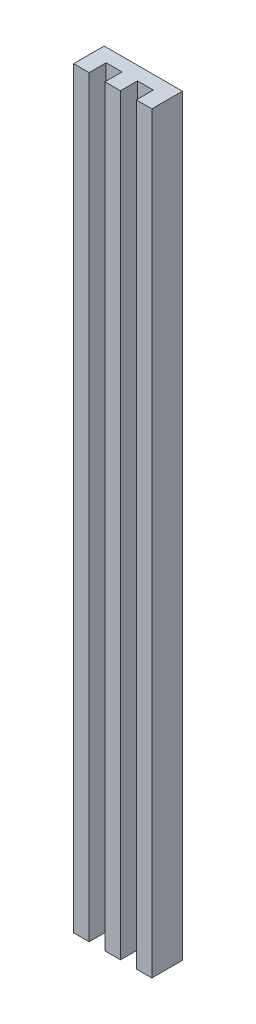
ISO-10303-21;
HEADER;
FILE_DESCRIPTION(('STEP AP214'),'2;1');
FILE_NAME('part.step','',(''),(''),'','','');
FILE_SCHEMA(('AUTOMOTIVE_DESIGN { 1 0 10303 214 1 1 1 1 }'));
ENDSEC;
DATA;
#1=APPLICATION_CONTEXT('core data for automotive mechanical design processes');
#2=APPLICATION_PROTOCOL_DEFINITION('international standard','automotive_design',2000,#1);
#3=PRODUCT_CONTEXT('',#1,'mechanical');
#4=PRODUCT('Part','Part','',(#3));
#5=PRODUCT_RELATED_PRODUCT_CATEGORY('part','',(#4));
#6=PRODUCT_DEFINITION_FORMATION('','',#4);
#7=PRODUCT_DEFINITION_CONTEXT('part definition',#1,'design');
#8=PRODUCT_DEFINITION('design','',#6,#7);
#9=PRODUCT_DEFINITION_SHAPE('','',#8);
#10=(LENGTH_UNIT() NAMED_UNIT(*) SI_UNIT(.MILLI.,.METRE.));
#11=(NAMED_UNIT(*) PLANE_ANGLE_UNIT() SI_UNIT($,.RADIAN.));
#12=(NAMED_UNIT(*) SI_UNIT($,.STERADIAN.) SOLID_ANGLE_UNIT());
#13=UNCERTAINTY_MEASURE_WITH_UNIT(LENGTH_MEASURE(1.E-05),#10,'distance_accuracy_value','');
#14=(GEOMETRIC_REPRESENTATION_CONTEXT(3) GLOBAL_UNCERTAINTY_ASSIGNED_CONTEXT((#13)) GLOBAL_UNIT_ASSIGNED_CONTEXT((#10,
#11,#12)) REPRESENTATION_CONTEXT('',''));
#15=CARTESIAN_POINT('',(0.,0.,0.));
#16=DIRECTION('',(0.,0.,1.));
#17=DIRECTION('',(1.,0.,0.));
#18=AXIS2_PLACEMENT_3D('',#15,#16,#17);
#19=CARTESIAN_POINT('',(3.1,75.,0.));
#20=DIRECTION('',(0.,0.,-1.));
#21=DIRECTION('',(-1.,0.,0.));
#22=AXIS2_PLACEMENT_3D('',#19,#20,#21);
#23=PLANE('',#22);
#24=DIRECTION('',(1.,0.,0.));
#25=VECTOR('',#24,1.);
#26=CARTESIAN_POINT('',(3.1,-75.,0.));
#27=LINE('',#26,#25);
#28=CARTESIAN_POINT('',(0.,-75.,0.));
#29=VERTEX_POINT('',#28);
#30=CARTESIAN_POINT('',(3.1,-75.,0.));
#31=VERTEX_POINT('',#30);
#32=EDGE_CURVE('E153',#29,#31,#27,.T.);
#33=ORIENTED_EDGE('',*,*,#32,.T.);
#34=DIRECTION('',(0.,-1.,0.));
#35=VECTOR('',#34,1.);
#36=CARTESIAN_POINT('',(3.1,75.,0.));
#37=LINE('',#36,#35);
#38=CARTESIAN_POINT('',(3.1,75.,0.));
#39=VERTEX_POINT('',#38);
#40=EDGE_CURVE('E11',#39,#31,#37,.T.);
#41=ORIENTED_EDGE('',*,*,#40,.F.);
#42=DIRECTION('',(1.,0.,0.));
#43=VECTOR('',#42,1.);
#44=CARTESIAN_POINT('',(3.1,75.,0.));
#45=LINE('',#44,#43);
#46=CARTESIAN_POINT('',(0.,75.,0.));
#47=VERTEX_POINT('',#46);
#48=EDGE_CURVE('E175',#47,#39,#45,.T.);
#49=ORIENTED_EDGE('',*,*,#48,.F.);
#50=DIRECTION('',(0.,-1.,0.));
#51=VECTOR('',#50,1.);
#52=CARTESIAN_POINT('',(0.,75.,0.));
#53=LINE('',#52,#51);
#54=EDGE_CURVE('E149',#47,#29,#53,.T.);
#55=ORIENTED_EDGE('',*,*,#54,.T.);
#56=EDGE_LOOP('',(#33,#41,#49,#55));
#57=FACE_BOUND('',#56,.T.);
#58=ADVANCED_FACE('F33',(#57),#23,.F.);
#59=CARTESIAN_POINT('',(3.1,75.,-3.4));
#60=DIRECTION('',(-1.,0.,0.));
#61=DIRECTION('',(0.,0.,1.));
#62=AXIS2_PLACEMENT_3D('',#59,#60,#61);
#63=PLANE('',#62);
#64=DIRECTION('',(0.,0.,-1.));
#65=VECTOR('',#64,1.);
#66=CARTESIAN_POINT('',(3.1,-75.,-3.4));
#67=LINE('',#66,#65);
#68=CARTESIAN_POINT('',(3.1,-75.,-3.4));
#69=VERTEX_POINT('',#68);
#70=EDGE_CURVE('E156',#31,#69,#67,.T.);
#71=ORIENTED_EDGE('',*,*,#70,.T.);
#72=DIRECTION('',(0.,-1.,0.));
#73=VECTOR('',#72,1.);
#74=CARTESIAN_POINT('',(3.1,75.,-3.4));
#75=LINE('',#74,#73);
#76=CARTESIAN_POINT('',(3.1,75.,-3.4));
#77=VERTEX_POINT('',#76);
#78=EDGE_CURVE('E41',#77,#69,#75,.T.);
#79=ORIENTED_EDGE('',*,*,#78,.F.);
#80=DIRECTION('',(0.,0.,-1.));
#81=VECTOR('',#80,1.);
#82=CARTESIAN_POINT('',(3.1,75.,-3.4));
#83=LINE('',#82,#81);
#84=EDGE_CURVE('E104',#39,#77,#83,.T.);
#85=ORIENTED_EDGE('',*,*,#84,.F.);
#86=ORIENTED_EDGE('',*,*,#40,.T.);
#87=EDGE_LOOP('',(#71,#79,#85,#86));
#88=FACE_BOUND('',#87,.T.);
#89=ADVANCED_FACE('F253',(#88),#63,.F.);
#90=CARTESIAN_POINT('',(6.25,75.,-3.4));
#91=DIRECTION('',(0.,0.,-1.));
#92=DIRECTION('',(-1.,0.,0.));
#93=AXIS2_PLACEMENT_3D('',#90,#91,#92);
#94=PLANE('',#93);
#95=DIRECTION('',(1.,0.,0.));
#96=VECTOR('',#95,1.);
#97=CARTESIAN_POINT('',(6.25,-75.,-3.4));
#98=LINE('',#97,#96);
#99=CARTESIAN_POINT('',(6.25,-75.,-3.4));
#100=VERTEX_POINT('',#99);
#101=EDGE_CURVE('E158',#69,#100,#98,.T.);
#102=ORIENTED_EDGE('',*,*,#101,.T.);
#103=DIRECTION('',(0.,-1.,0.));
#104=VECTOR('',#103,1.);
#105=CARTESIAN_POINT('',(6.25,75.,-3.4));
#106=LINE('',#105,#104);
#107=CARTESIAN_POINT('',(6.25,75.,-3.4));
#108=VERTEX_POINT('',#107);
#109=EDGE_CURVE('E194',#108,#100,#106,.T.);
#110=ORIENTED_EDGE('',*,*,#109,.F.);
#111=DIRECTION('',(1.,0.,0.));
#112=VECTOR('',#111,1.);
#113=CARTESIAN_POINT('',(6.25,75.,-3.4));
#114=LINE('',#113,#112);
#115=EDGE_CURVE('E202',#77,#108,#114,.T.);
#116=ORIENTED_EDGE('',*,*,#115,.F.);
#117=ORIENTED_EDGE('',*,*,#78,.T.);
#118=EDGE_LOOP('',(#102,#110,#116,#117));
#119=FACE_BOUND('',#118,.T.);
#120=ADVANCED_FACE('F200',(#119),#94,.F.);
#121=CARTESIAN_POINT('',(6.25,75.,0.));
#122=DIRECTION('',(1.,0.,0.));
#123=DIRECTION('',(0.,0.,-1.));
#124=AXIS2_PLACEMENT_3D('',#121,#122,#123);
#125=PLANE('',#124);
#126=DIRECTION('',(0.,0.,1.));
#127=VECTOR('',#126,1.);
#128=CARTESIAN_POINT('',(6.25,-75.,0.));
#129=LINE('',#128,#127);
#130=CARTESIAN_POINT('',(6.25,-75.,0.));
#131=VERTEX_POINT('',#130);
#132=EDGE_CURVE('E160',#100,#131,#129,.T.);
#133=ORIENTED_EDGE('',*,*,#132,.T.);
#134=DIRECTION('',(0.,-1.,0.));
#135=VECTOR('',#134,1.);
#136=CARTESIAN_POINT('',(6.25,75.,0.));
#137=LINE('',#136,#135);
#138=CARTESIAN_POINT('',(6.25,75.,0.));
#139=VERTEX_POINT('',#138);
#140=EDGE_CURVE('E191',#139,#131,#137,.T.);
#141=ORIENTED_EDGE('',*,*,#140,.F.);
#142=DIRECTION('',(0.,0.,1.));
#143=VECTOR('',#142,1.);
#144=CARTESIAN_POINT('',(6.25,75.,0.));
#145=LINE('',#144,#143);
#146=EDGE_CURVE('E220',#108,#139,#145,.T.);
#147=ORIENTED_EDGE('',*,*,#146,.F.);
#148=ORIENTED_EDGE('',*,*,#109,.T.);
#149=EDGE_LOOP('',(#133,#141,#147,#148));
#150=FACE_BOUND('',#149,.T.);
#151=ADVANCED_FACE('F211',(#150),#125,.F.);
#152=CARTESIAN_POINT('',(9.35,75.,0.));
#153=DIRECTION('',(0.,0.,-1.));
#154=DIRECTION('',(-1.,0.,0.));
#155=AXIS2_PLACEMENT_3D('',#152,#153,#154);
#156=PLANE('',#155);
#157=DIRECTION('',(1.,0.,0.));
#158=VECTOR('',#157,1.);
#159=CARTESIAN_POINT('',(9.35,-75.,0.));
#160=LINE('',#159,#158);
#161=CARTESIAN_POINT('',(9.35,-75.,0.));
#162=VERTEX_POINT('',#161);
#163=EDGE_CURVE('E162',#131,#162,#160,.T.);
#164=ORIENTED_EDGE('',*,*,#163,.T.);
#165=DIRECTION('',(0.,-1.,0.));
#166=VECTOR('',#165,1.);
#167=CARTESIAN_POINT('',(9.35,75.,0.));
#168=LINE('',#167,#166);
#169=CARTESIAN_POINT('',(9.35,75.,0.));
#170=VERTEX_POINT('',#169);
#171=EDGE_CURVE('E188',#170,#162,#168,.T.);
#172=ORIENTED_EDGE('',*,*,#171,.F.);
#173=DIRECTION('',(1.,0.,0.));
#174=VECTOR('',#173,1.);
#175=CARTESIAN_POINT('',(9.35,75.,0.));
#176=LINE('',#175,#174);
#177=EDGE_CURVE('E217',#139,#170,#176,.T.);
#178=ORIENTED_EDGE('',*,*,#177,.F.);
#179=ORIENTED_EDGE('',*,*,#140,.T.);
#180=EDGE_LOOP('',(#164,#172,#178,#179));
#181=FACE_BOUND('',#180,.T.);
#182=ADVANCED_FACE('F215',(#181),#156,.F.);
#183=CARTESIAN_POINT('',(9.35,75.,-3.4));
#184=DIRECTION('',(-1.,0.,0.));
#185=DIRECTION('',(0.,0.,1.));
#186=AXIS2_PLACEMENT_3D('',#183,#184,#185);
#187=PLANE('',#186);
#188=DIRECTION('',(0.,0.,-1.));
#189=VECTOR('',#188,1.);
#190=CARTESIAN_POINT('',(9.35,-75.,-3.4));
#191=LINE('',#190,#189);
#192=CARTESIAN_POINT('',(9.35,-75.,-3.4));
#193=VERTEX_POINT('',#192);
#194=EDGE_CURVE('E164',#162,#193,#191,.T.);
#195=ORIENTED_EDGE('',*,*,#194,.T.);
#196=DIRECTION('',(0.,-1.,0.));
#197=VECTOR('',#196,1.);
#198=CARTESIAN_POINT('',(9.35,75.,-3.4));
#199=LINE('',#198,#197);
#200=CARTESIAN_POINT('',(9.35,75.,-3.4));
#201=VERTEX_POINT('',#200);
#202=EDGE_CURVE('E185',#201,#193,#199,.T.);
#203=ORIENTED_EDGE('',*,*,#202,.F.);
#204=DIRECTION('',(0.,0.,-1.));
#205=VECTOR('',#204,1.);
#206=CARTESIAN_POINT('',(9.35,75.,-3.4));
#207=LINE('',#206,#205);
#208=EDGE_CURVE('E219',#170,#201,#207,.T.);
#209=ORIENTED_EDGE('',*,*,#208,.F.);
#210=ORIENTED_EDGE('',*,*,#171,.T.);
#211=EDGE_LOOP('',(#195,#203,#209,#210));
#212=FACE_BOUND('',#211,.T.);
#213=ADVANCED_FACE('F266',(#212),#187,.F.);
#214=CARTESIAN_POINT('',(12.5,75.,-3.4));
#215=DIRECTION('',(0.,0.,-1.));
#216=DIRECTION('',(-1.,0.,0.));
#217=AXIS2_PLACEMENT_3D('',#214,#215,#216);
#218=PLANE('',#217);
#219=DIRECTION('',(1.,0.,0.));
#220=VECTOR('',#219,1.);
#221=CARTESIAN_POINT('',(12.5,-75.,-3.4));
#222=LINE('',#221,#220);
#223=CARTESIAN_POINT('',(12.5,-75.,-3.4));
#224=VERTEX_POINT('',#223);
#225=EDGE_CURVE('E166',#193,#224,#222,.T.);
#226=ORIENTED_EDGE('',*,*,#225,.T.);
#227=DIRECTION('',(0.,-1.,0.));
#228=VECTOR('',#227,1.);
#229=CARTESIAN_POINT('',(12.5,75.,-3.4));
#230=LINE('',#229,#228);
#231=CARTESIAN_POINT('',(12.5,75.,-3.4));
#232=VERTEX_POINT('',#231);
#233=EDGE_CURVE('E182',#232,#224,#230,.T.);
#234=ORIENTED_EDGE('',*,*,#233,.F.);
#235=DIRECTION('',(1.,0.,0.));
#236=VECTOR('',#235,1.);
#237=CARTESIAN_POINT('',(12.5,75.,-3.4));
#238=LINE('',#237,#236);
#239=EDGE_CURVE('E222',#201,#232,#238,.T.);
#240=ORIENTED_EDGE('',*,*,#239,.F.);
#241=ORIENTED_EDGE('',*,*,#202,.T.);
#242=EDGE_LOOP('',(#226,#234,#240,#241));
#243=FACE_BOUND('',#242,.T.);
#244=ADVANCED_FACE('F269',(#243),#218,.F.);
#245=CARTESIAN_POINT('',(12.5,75.,0.));
#246=DIRECTION('',(1.,0.,0.));
#247=DIRECTION('',(0.,0.,-1.));
#248=AXIS2_PLACEMENT_3D('',#245,#246,#247);
#249=PLANE('',#248);
#250=DIRECTION('',(0.,0.,1.));
#251=VECTOR('',#250,1.);
#252=CARTESIAN_POINT('',(12.5,-75.,0.));
#253=LINE('',#252,#251);
#254=CARTESIAN_POINT('',(12.5,-75.,0.));
#255=VERTEX_POINT('',#254);
#256=EDGE_CURVE('E168',#224,#255,#253,.T.);
#257=ORIENTED_EDGE('',*,*,#256,.T.);
#258=DIRECTION('',(0.,-1.,0.));
#259=VECTOR('',#258,1.);
#260=CARTESIAN_POINT('',(12.5,75.,0.));
#261=LINE('',#260,#259);
#262=CARTESIAN_POINT('',(12.5,75.,0.));
#263=VERTEX_POINT('',#262);
#264=EDGE_CURVE('E179',#263,#255,#261,.T.);
#265=ORIENTED_EDGE('',*,*,#264,.F.);
#266=DIRECTION('',(0.,0.,1.));
#267=VECTOR('',#266,1.);
#268=CARTESIAN_POINT('',(12.5,75.,0.));
#269=LINE('',#268,#267);
#270=EDGE_CURVE('E228',#232,#263,#269,.T.);
#271=ORIENTED_EDGE('',*,*,#270,.F.);
#272=ORIENTED_EDGE('',*,*,#233,.T.);
#273=EDGE_LOOP('',(#257,#265,#271,#272));
#274=FACE_BOUND('',#273,.T.);
#275=ADVANCED_FACE('F234',(#274),#249,.F.);
#276=CARTESIAN_POINT('',(15.6,75.,0.));
#277=DIRECTION('',(0.,0.,-1.));
#278=DIRECTION('',(-1.,0.,0.));
#279=AXIS2_PLACEMENT_3D('',#276,#277,#278);
#280=PLANE('',#279);
#281=DIRECTION('',(1.,0.,0.));
#282=VECTOR('',#281,1.);
#283=CARTESIAN_POINT('',(15.6,-75.,0.));
#284=LINE('',#283,#282);
#285=CARTESIAN_POINT('',(15.6,-75.,0.));
#286=VERTEX_POINT('',#285);
#287=EDGE_CURVE('E170',#255,#286,#284,.T.);
#288=ORIENTED_EDGE('',*,*,#287,.T.);
#289=DIRECTION('',(0.,-1.,0.));
#290=VECTOR('',#289,1.);
#291=CARTESIAN_POINT('',(15.6,75.,0.));
#292=LINE('',#291,#290);
#293=CARTESIAN_POINT('',(15.6,75.,0.));
#294=VERTEX_POINT('',#293);
#295=EDGE_CURVE('E144',#294,#286,#292,.T.);
#296=ORIENTED_EDGE('',*,*,#295,.F.);
#297=DIRECTION('',(1.,0.,0.));
#298=VECTOR('',#297,1.);
#299=CARTESIAN_POINT('',(15.6,75.,0.));
#300=LINE('',#299,#298);
#301=EDGE_CURVE('E135',#263,#294,#300,.T.);
#302=ORIENTED_EDGE('',*,*,#301,.F.);
#303=ORIENTED_EDGE('',*,*,#264,.T.);
#304=EDGE_LOOP('',(#288,#296,#302,#303));
#305=FACE_BOUND('',#304,.T.);
#306=ADVANCED_FACE('F238',(#305),#280,.F.);
#307=CARTESIAN_POINT('',(15.6,75.,-6.1));
#308=DIRECTION('',(-1.,0.,0.));
#309=DIRECTION('',(0.,0.,1.));
#310=AXIS2_PLACEMENT_3D('',#307,#308,#309);
#311=PLANE('',#310);
#312=DIRECTION('',(0.,0.,-1.));
#313=VECTOR('',#312,1.);
#314=CARTESIAN_POINT('',(15.6,-75.,-6.1));
#315=LINE('',#314,#313);
#316=CARTESIAN_POINT('',(15.6,-75.,-6.1));
#317=VERTEX_POINT('',#316);
#318=EDGE_CURVE('E143',#286,#317,#315,.T.);
#319=ORIENTED_EDGE('',*,*,#318,.T.);
#320=DIRECTION('',(0.,-1.,0.));
#321=VECTOR('',#320,1.);
#322=CARTESIAN_POINT('',(15.6,75.,-6.1));
#323=LINE('',#322,#321);
#324=CARTESIAN_POINT('',(15.6,75.,-6.1));
#325=VERTEX_POINT('',#324);
#326=EDGE_CURVE('E140',#325,#317,#323,.T.);
#327=ORIENTED_EDGE('',*,*,#326,.F.);
#328=DIRECTION('',(0.,0.,-1.));
#329=VECTOR('',#328,1.);
#330=CARTESIAN_POINT('',(15.6,75.,-6.1));
#331=LINE('',#330,#329);
#332=EDGE_CURVE('E129',#294,#325,#331,.T.);
#333=ORIENTED_EDGE('',*,*,#332,.F.);
#334=ORIENTED_EDGE('',*,*,#295,.T.);
#335=EDGE_LOOP('',(#319,#327,#333,#334));
#336=FACE_BOUND('',#335,.T.);
#337=ADVANCED_FACE('F141',(#336),#311,.F.);
#338=CARTESIAN_POINT('',(0.,75.,-6.1));
#339=DIRECTION('',(0.,0.,1.));
#340=DIRECTION('',(1.,0.,0.));
#341=AXIS2_PLACEMENT_3D('',#338,#339,#340);
#342=PLANE('',#341);
#343=DIRECTION('',(-1.,0.,0.));
#344=VECTOR('',#343,1.);
#345=CARTESIAN_POINT('',(0.,-75.,-6.1));
#346=LINE('',#345,#344);
#347=CARTESIAN_POINT('',(0.,-75.,-6.1));
#348=VERTEX_POINT('',#347);
#349=EDGE_CURVE('E90',#317,#348,#346,.T.);
#350=ORIENTED_EDGE('',*,*,#349,.T.);
#351=DIRECTION('',(0.,-1.,0.));
#352=VECTOR('',#351,1.);
#353=CARTESIAN_POINT('',(0.,75.,-6.1));
#354=LINE('',#353,#352);
#355=CARTESIAN_POINT('',(0.,75.,-6.1));
#356=VERTEX_POINT('',#355);
#357=EDGE_CURVE('E145',#356,#348,#354,.T.);
#358=ORIENTED_EDGE('',*,*,#357,.F.);
#359=DIRECTION('',(-1.,0.,0.));
#360=VECTOR('',#359,1.);
#361=CARTESIAN_POINT('',(0.,75.,-6.1));
#362=LINE('',#361,#360);
#363=EDGE_CURVE('E133',#325,#356,#362,.T.);
#364=ORIENTED_EDGE('',*,*,#363,.F.);
#365=ORIENTED_EDGE('',*,*,#326,.T.);
#366=EDGE_LOOP('',(#350,#358,#364,#365));
#367=FACE_BOUND('',#366,.T.);
#368=ADVANCED_FACE('F147',(#367),#342,.F.);
#369=CARTESIAN_POINT('',(0.,75.,0.));
#370=DIRECTION('',(1.,0.,0.));
#371=DIRECTION('',(0.,0.,-1.));
#372=AXIS2_PLACEMENT_3D('',#369,#370,#371);
#373=PLANE('',#372);
#374=DIRECTION('',(0.,0.,1.));
#375=VECTOR('',#374,1.);
#376=CARTESIAN_POINT('',(0.,-75.,0.));
#377=LINE('',#376,#375);
#378=EDGE_CURVE('E96',#348,#29,#377,.T.);
#379=ORIENTED_EDGE('',*,*,#378,.T.);
#380=ORIENTED_EDGE('',*,*,#54,.F.);
#381=DIRECTION('',(0.,0.,1.));
#382=VECTOR('',#381,1.);
#383=CARTESIAN_POINT('',(0.,75.,0.));
#384=LINE('',#383,#382);
#385=EDGE_CURVE('E49',#356,#47,#384,.T.);
#386=ORIENTED_EDGE('',*,*,#385,.F.);
#387=ORIENTED_EDGE('',*,*,#357,.T.);
#388=EDGE_LOOP('',(#379,#380,#386,#387));
#389=FACE_BOUND('',#388,.T.);
#390=ADVANCED_FACE('F242',(#389),#373,.F.);
#391=CARTESIAN_POINT('',(0.,75.,0.));
#392=DIRECTION('',(0.,-1.,0.));
#393=DIRECTION('',(0.,0.,-1.));
#394=AXIS2_PLACEMENT_3D('',#391,#392,#393);
#395=PLANE('',#394);
#396=ORIENTED_EDGE('',*,*,#48,.T.);
#397=ORIENTED_EDGE('',*,*,#84,.T.);
#398=ORIENTED_EDGE('',*,*,#115,.T.);
#399=ORIENTED_EDGE('',*,*,#146,.T.);
#400=ORIENTED_EDGE('',*,*,#177,.T.);
#401=ORIENTED_EDGE('',*,*,#208,.T.);
#402=ORIENTED_EDGE('',*,*,#239,.T.);
#403=ORIENTED_EDGE('',*,*,#270,.T.);
#404=ORIENTED_EDGE('',*,*,#301,.T.);
#405=ORIENTED_EDGE('',*,*,#332,.T.);
#406=ORIENTED_EDGE('',*,*,#363,.T.);
#407=ORIENTED_EDGE('',*,*,#385,.T.);
#408=EDGE_LOOP('',(#396,#397,#398,#399,#400,#401,#402,#403,#404,#405,#406,#407));
#409=FACE_BOUND('',#408,.T.);
#410=ADVANCED_FACE('F131',(#409),#395,.F.);
#411=CARTESIAN_POINT('',(0.,-75.,0.));
#412=DIRECTION('',(0.,-1.,0.));
#413=DIRECTION('',(0.,0.,-1.));
#414=AXIS2_PLACEMENT_3D('',#411,#412,#413);
#415=PLANE('',#414);
#416=ORIENTED_EDGE('',*,*,#32,.F.);
#417=ORIENTED_EDGE('',*,*,#378,.F.);
#418=ORIENTED_EDGE('',*,*,#349,.F.);
#419=ORIENTED_EDGE('',*,*,#318,.F.);
#420=ORIENTED_EDGE('',*,*,#287,.F.);
#421=ORIENTED_EDGE('',*,*,#256,.F.);
#422=ORIENTED_EDGE('',*,*,#225,.F.);
#423=ORIENTED_EDGE('',*,*,#194,.F.);
#424=ORIENTED_EDGE('',*,*,#163,.F.);
#425=ORIENTED_EDGE('',*,*,#132,.F.);
#426=ORIENTED_EDGE('',*,*,#101,.F.);
#427=ORIENTED_EDGE('',*,*,#70,.F.);
#428=EDGE_LOOP('',(#416,#417,#418,#419,#420,#421,#422,#423,#424,#425,#426,#427));
#429=FACE_BOUND('',#428,.T.);
#430=ADVANCED_FACE('F206',(#429),#415,.T.);
#431=CLOSED_SHELL('',(#58,#89,#120,#151,#182,#213,#244,#275,#306,#337,#368,#390,#410,#430));
#432=MANIFOLD_SOLID_BREP('B2',#431);
#433=ADVANCED_BREP_SHAPE_REPRESENTATION('',(#18,#432),#14);
#434=SHAPE_DEFINITION_REPRESENTATION(#9,#433);
ENDSEC;
END-ISO-10303-21;
